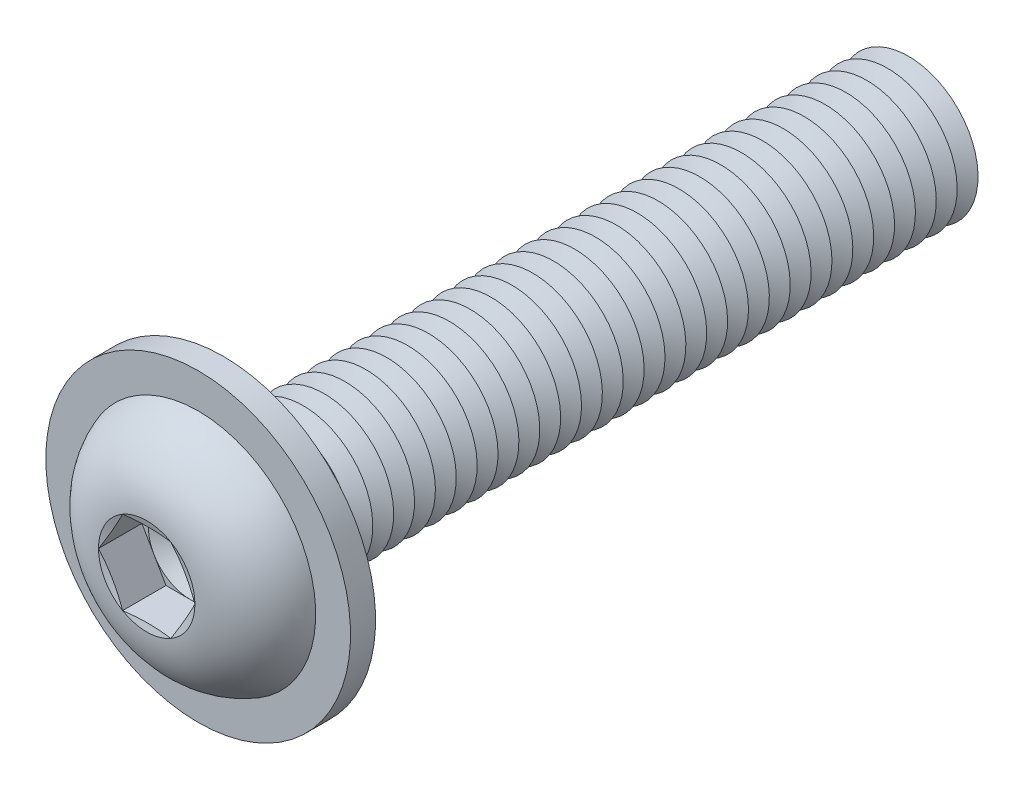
from build123d import *

# Parameters (mm, degrees)
FILLET1_R           = 0.75
LPATTERN1_COUNT     = 33
LPATTERN1_PITCH     = 1.5
CUT_EXTRUDE1_DEPTH  = 3.12
SKETCH5_R           = 10.95
SKETCH5_R_2         = 5.75
BOSS_EXTRUDE1_DEPTH = 1.8


with BuildPart() as part:
    # Sketch1 → Revolve1 (revolve)
    with BuildSketch(Plane(origin=(0, 0, 0), x_dir=(0, 0, -1), z_dir=(1, 0, 0))):
        with BuildLine():
            Line((0, 5), (0, 8.75))
            ThreePointArc((0, 8.75), (-3.814142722, 7.21429474), (-5.5, 3.4641))
            Line((-5.5, 3.4641), (-5.035898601, 1.73205))
            Line((-5.035898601, 1.73205), (-5.5, 1.73205))
            Line((-5.5, 1.73205), (-5.5, 0))
            Line((-5.5, 0), (50, 0))
            Line((50, 0), (50, 5))
            Line((50, 5), (0, 5))
        make_face()
    revolve(axis=Axis((0, 0, -50), (0, 0, 1)))

    # Fillet1
    fillet1_edges = [part.edges().sort_by_distance(p)[0] for p in [
        (0, -5, 0),
    ]]
    fillet(fillet1_edges, radius=FILLET1_R)

    # Sketch2 → Cut-Revolve1 (revolve, cut)
    with BuildSketch(Plane(origin=(0, 0, 0), x_dir=(0, 0, -1), z_dir=(1, 0, 0))):
        Polygon((49.25, 5), (50.75, 5), (50, 3.700961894), align=None)
    cut_revolve1 = revolve(axis=Axis((0, 0, -50), (0, 0, -1)), mode=Mode.SUBTRACT)

    # LPattern1: Cut-Revolve1 ×33
    with Locations(*[(0, 0, i * LPATTERN1_PITCH) for i in range(1, LPATTERN1_COUNT)]):
        add(cut_revolve1, mode=Mode.SUBTRACT)

    # Sketch3 → Cut-Extrude1 (cut)
    with BuildSketch(Plane.XY.offset(5.5)):
        Polygon((1.73205, 2.999998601), (-1.73205, 2.999998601), (-3.4641, 0), (-1.73205, -2.999998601), (1.73205, -2.999998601), (3.4641, 0), align=None)
    extrude(amount=-CUT_EXTRUDE1_DEPTH, mode=Mode.SUBTRACT)

    # Cut-Extrude2 cone 1 section (on through the dimple's axis) → Cut-Extrude2 (revolve, cut)
    with BuildSketch(Plane(origin=(0, 0, 2.38), x_dir=(0, -1, 0), z_dir=(1, 0, 0))):
        Polygon((0, 0), (2.999998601, 0), (0, 1.73205), align=None)
    revolve(axis=Axis((0, 0, 2.38), (0, 0, -1)), mode=Mode.SUBTRACT)

    # Sketch5 → Boss-Extrude1 (add)
    with BuildSketch(Plane(origin=(0, 0, 0), x_dir=(-1, 0, 0), z_dir=(0, 0, -1))):
        with Locations(Location((0, 0, 0), (0, 0, 90))):
            Circle(SKETCH5_R)
        Circle(SKETCH5_R_2, mode=Mode.SUBTRACT)
    extrude(amount=-BOSS_EXTRUDE1_DEPTH)


solid = part.part
